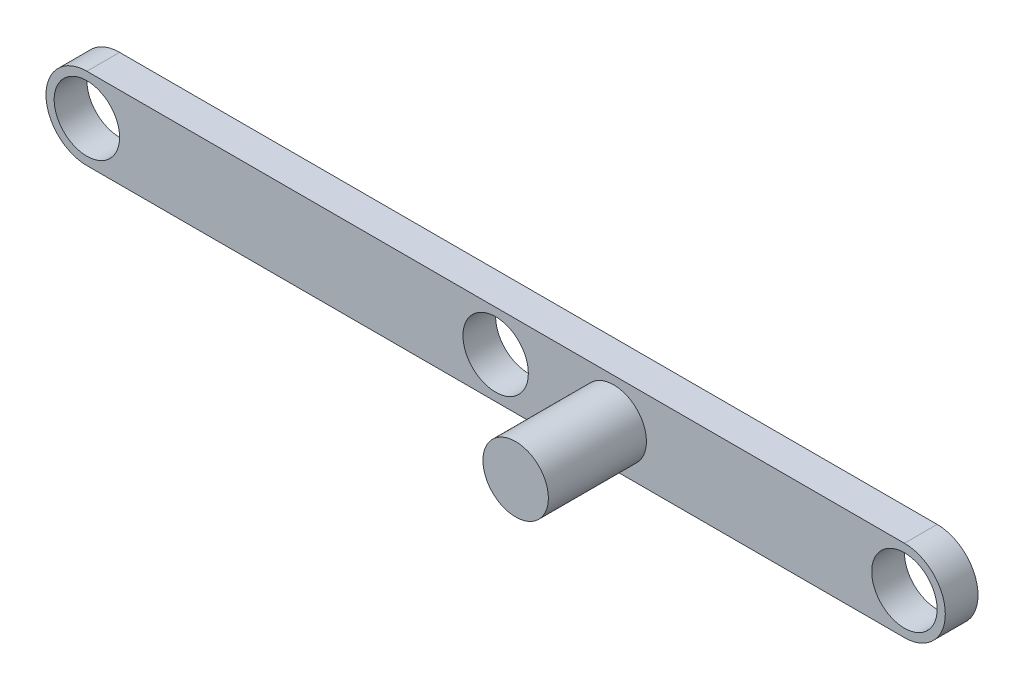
ISO-10303-21;
HEADER;
FILE_DESCRIPTION(('STEP AP214'),'2;1');
FILE_NAME('part.step','',(''),(''),'','','');
FILE_SCHEMA(('AUTOMOTIVE_DESIGN { 1 0 10303 214 1 1 1 1 }'));
ENDSEC;
DATA;
#1=APPLICATION_CONTEXT('core data for automotive mechanical design processes');
#2=APPLICATION_PROTOCOL_DEFINITION('international standard','automotive_design',2000,#1);
#3=PRODUCT_CONTEXT('',#1,'mechanical');
#4=PRODUCT('Part','Part','',(#3));
#5=PRODUCT_RELATED_PRODUCT_CATEGORY('part','',(#4));
#6=PRODUCT_DEFINITION_FORMATION('','',#4);
#7=PRODUCT_DEFINITION_CONTEXT('part definition',#1,'design');
#8=PRODUCT_DEFINITION('design','',#6,#7);
#9=PRODUCT_DEFINITION_SHAPE('','',#8);
#10=(LENGTH_UNIT() NAMED_UNIT(*) SI_UNIT(.MILLI.,.METRE.));
#11=(NAMED_UNIT(*) PLANE_ANGLE_UNIT() SI_UNIT($,.RADIAN.));
#12=(NAMED_UNIT(*) SI_UNIT($,.STERADIAN.) SOLID_ANGLE_UNIT());
#13=UNCERTAINTY_MEASURE_WITH_UNIT(LENGTH_MEASURE(1.E-05),#10,'distance_accuracy_value','');
#14=(GEOMETRIC_REPRESENTATION_CONTEXT(3) GLOBAL_UNCERTAINTY_ASSIGNED_CONTEXT((#13)) GLOBAL_UNIT_ASSIGNED_CONTEXT((#10,
#11,#12)) REPRESENTATION_CONTEXT('',''));
#15=CARTESIAN_POINT('',(0.,0.,0.));
#16=DIRECTION('',(0.,0.,1.));
#17=DIRECTION('',(1.,0.,0.));
#18=AXIS2_PLACEMENT_3D('',#15,#16,#17);
#19=CARTESIAN_POINT('',(1275.04046692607,63.4999999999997,0.));
#20=DIRECTION('',(0.,0.,-0.999999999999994));
#21=DIRECTION('',(-0.999999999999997,0.,0.));
#22=AXIS2_PLACEMENT_3D('',#19,#20,#21);
#23=PLANE('',#22);
#24=CARTESIAN_POINT('',(1275.04046692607,63.4999999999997,0.));
#25=DIRECTION('',(0.,0.,0.999999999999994));
#26=DIRECTION('',(-0.999999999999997,0.,0.));
#27=AXIS2_PLACEMENT_3D('',#24,#25,#26);
#28=CIRCLE('',#27,63.5);
#29=CARTESIAN_POINT('',(1275.04046692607,0.,0.));
#30=VERTEX_POINT('',#29);
#31=CARTESIAN_POINT('',(1275.04046692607,127.,0.));
#32=VERTEX_POINT('',#31);
#33=EDGE_CURVE('E391',#30,#32,#28,.T.);
#34=ORIENTED_EDGE('',*,*,#33,.T.);
#35=DIRECTION('',(-0.999999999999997,0.,0.));
#36=VECTOR('',#35,1.);
#37=CARTESIAN_POINT('',(1275.04046692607,127.,0.));
#38=LINE('',#37,#36);
#39=CARTESIAN_POINT('',(5.04046692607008,127.,0.));
#40=VERTEX_POINT('',#39);
#41=EDGE_CURVE('E400',#32,#40,#38,.T.);
#42=ORIENTED_EDGE('',*,*,#41,.T.);
#43=CARTESIAN_POINT('',(5.04046692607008,63.5000000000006,0.));
#44=DIRECTION('',(0.,0.,0.999999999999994));
#45=DIRECTION('',(0.999999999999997,0.,0.));
#46=AXIS2_PLACEMENT_3D('',#43,#44,#45);
#47=CIRCLE('',#46,63.5);
#48=CARTESIAN_POINT('',(5.04046692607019,-2.22044604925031E-13,0.));
#49=VERTEX_POINT('',#48);
#50=EDGE_CURVE('E405',#40,#49,#47,.T.);
#51=ORIENTED_EDGE('',*,*,#50,.T.);
#52=DIRECTION('',(1.,0.,0.));
#53=VECTOR('',#52,1.);
#54=CARTESIAN_POINT('',(1275.04046692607,0.,0.));
#55=LINE('',#54,#53);
#56=EDGE_CURVE('E408',#49,#30,#55,.T.);
#57=ORIENTED_EDGE('',*,*,#56,.T.);
#58=EDGE_LOOP('',(#34,#42,#51,#57));
#59=FACE_BOUND('',#58,.T.);
#60=CARTESIAN_POINT('',(640.04046692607,63.5000000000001,0.));
#61=DIRECTION('',(0.,0.,0.999999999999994));
#62=DIRECTION('',(0.999999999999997,0.,0.));
#63=AXIS2_PLACEMENT_3D('',#60,#61,#62);
#64=CIRCLE('',#63,50.8);
#65=CARTESIAN_POINT('',(690.84046692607,63.5,0.));
#66=VERTEX_POINT('',#65);
#67=EDGE_CURVE('E412',#66,#66,#64,.T.);
#68=ORIENTED_EDGE('',*,*,#67,.F.);
#69=EDGE_LOOP('',(#68));
#70=FACE_BOUND('',#69,.T.);
#71=CARTESIAN_POINT('',(1275.04046692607,63.4999999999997,0.));
#72=DIRECTION('',(0.,0.,0.999999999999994));
#73=DIRECTION('',(0.999999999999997,0.,0.));
#74=AXIS2_PLACEMENT_3D('',#71,#72,#73);
#75=CIRCLE('',#74,50.8);
#76=CARTESIAN_POINT('',(1325.84046692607,63.4999999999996,0.));
#77=VERTEX_POINT('',#76);
#78=EDGE_CURVE('E480',#77,#77,#75,.T.);
#79=ORIENTED_EDGE('',*,*,#78,.F.);
#80=EDGE_LOOP('',(#79));
#81=FACE_BOUND('',#80,.T.);
#82=CARTESIAN_POINT('',(5.04046692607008,63.5000000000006,0.));
#83=DIRECTION('',(0.,0.,0.999999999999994));
#84=DIRECTION('',(0.999999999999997,0.,0.));
#85=AXIS2_PLACEMENT_3D('',#82,#83,#84);
#86=CIRCLE('',#85,50.8);
#87=CARTESIAN_POINT('',(55.84046692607,63.4999999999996,0.));
#88=VERTEX_POINT('',#87);
#89=EDGE_CURVE('E470',#88,#88,#86,.T.);
#90=ORIENTED_EDGE('',*,*,#89,.F.);
#91=EDGE_LOOP('',(#90));
#92=FACE_BOUND('',#91,.T.);
#93=CARTESIAN_POINT('',(823.47438328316,63.5000000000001,0.));
#94=DIRECTION('',(0.,0.,0.999999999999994));
#95=DIRECTION('',(0.999999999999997,0.,0.));
#96=AXIS2_PLACEMENT_3D('',#93,#94,#95);
#97=CIRCLE('',#96,50.8);
#98=CARTESIAN_POINT('',(772.67438328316,63.5000000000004,0.));
#99=VERTEX_POINT('',#98);
#100=EDGE_CURVE('E471',#99,#99,#97,.T.);
#101=ORIENTED_EDGE('',*,*,#100,.F.);
#102=EDGE_LOOP('',(#101));
#103=FACE_BOUND('',#102,.T.);
#104=ADVANCED_FACE('F350',(#59,#70,#81,#92,#103),#23,.F.);
#105=CARTESIAN_POINT('',(1275.04046692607,63.4999999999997,-50.7999999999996));
#106=DIRECTION('',(0.,0.,0.999999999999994));
#107=DIRECTION('',(0.999999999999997,0.,0.));
#108=AXIS2_PLACEMENT_3D('',#105,#106,#107);
#109=CYLINDRICAL_SURFACE('',#108,63.5);
#110=ORIENTED_EDGE('',*,*,#33,.F.);
#111=DIRECTION('',(0.,0.,0.999999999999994));
#112=VECTOR('',#111,1.);
#113=CARTESIAN_POINT('',(1275.04046692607,0.,-50.7999999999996));
#114=LINE('',#113,#112);
#115=CARTESIAN_POINT('',(1275.04046692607,0.,-50.7999999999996));
#116=VERTEX_POINT('',#115);
#117=EDGE_CURVE('E11',#116,#30,#114,.T.);
#118=ORIENTED_EDGE('',*,*,#117,.F.);
#119=CARTESIAN_POINT('',(1275.04046692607,63.4999999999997,-50.7999999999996));
#120=DIRECTION('',(0.,0.,0.999999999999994));
#121=DIRECTION('',(-0.999999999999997,0.,0.));
#122=AXIS2_PLACEMENT_3D('',#119,#120,#121);
#123=CIRCLE('',#122,63.5);
#124=CARTESIAN_POINT('',(1275.04046692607,127.,-50.7999999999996));
#125=VERTEX_POINT('',#124);
#126=EDGE_CURVE('E393',#116,#125,#123,.T.);
#127=ORIENTED_EDGE('',*,*,#126,.T.);
#128=DIRECTION('',(0.,0.,0.999999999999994));
#129=VECTOR('',#128,1.);
#130=CARTESIAN_POINT('',(1275.04046692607,127.,-50.7999999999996));
#131=LINE('',#130,#129);
#132=EDGE_CURVE('E354',#125,#32,#131,.T.);
#133=ORIENTED_EDGE('',*,*,#132,.T.);
#134=EDGE_LOOP('',(#110,#118,#127,#133));
#135=FACE_BOUND('',#134,.T.);
#136=ADVANCED_FACE('F352',(#135),#109,.T.);
#137=CARTESIAN_POINT('',(1275.04046692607,0.,-50.7999999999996));
#138=DIRECTION('',(0.,-0.999999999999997,0.));
#139=DIRECTION('',(0.999999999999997,0.,0.));
#140=AXIS2_PLACEMENT_3D('',#137,#138,#139);
#141=PLANE('',#140);
#142=ORIENTED_EDGE('',*,*,#56,.F.);
#143=DIRECTION('',(0.,0.,0.999999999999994));
#144=VECTOR('',#143,1.);
#145=CARTESIAN_POINT('',(5.04046692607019,-2.22044604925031E-13,-50.7999999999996));
#146=LINE('',#145,#144);
#147=CARTESIAN_POINT('',(5.04046692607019,-2.22044604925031E-13,-50.7999999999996));
#148=VERTEX_POINT('',#147);
#149=EDGE_CURVE('E359',#148,#49,#146,.T.);
#150=ORIENTED_EDGE('',*,*,#149,.F.);
#151=DIRECTION('',(1.,0.,0.));
#152=VECTOR('',#151,1.);
#153=CARTESIAN_POINT('',(1275.04046692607,0.,-50.7999999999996));
#154=LINE('',#153,#152);
#155=EDGE_CURVE('E398',#148,#116,#154,.T.);
#156=ORIENTED_EDGE('',*,*,#155,.T.);
#157=ORIENTED_EDGE('',*,*,#117,.T.);
#158=EDGE_LOOP('',(#142,#150,#156,#157));
#159=FACE_BOUND('',#158,.T.);
#160=ADVANCED_FACE('F428',(#159),#141,.T.);
#161=CARTESIAN_POINT('',(5.04046692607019,63.4999999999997,-50.7999999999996));
#162=DIRECTION('',(0.,0.,0.999999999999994));
#163=DIRECTION('',(0.999999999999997,0.,0.));
#164=AXIS2_PLACEMENT_3D('',#161,#162,#163);
#165=CYLINDRICAL_SURFACE('',#164,63.5);
#166=ORIENTED_EDGE('',*,*,#50,.F.);
#167=DIRECTION('',(0.,0.,0.999999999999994));
#168=VECTOR('',#167,1.);
#169=CARTESIAN_POINT('',(5.04046692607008,127.,-50.7999999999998));
#170=LINE('',#169,#168);
#171=CARTESIAN_POINT('',(5.04046692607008,127.,-50.7999999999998));
#172=VERTEX_POINT('',#171);
#173=EDGE_CURVE('E397',#172,#40,#170,.T.);
#174=ORIENTED_EDGE('',*,*,#173,.F.);
#175=CARTESIAN_POINT('',(5.04046692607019,63.4999999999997,-50.7999999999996));
#176=DIRECTION('',(0.,0.,0.999999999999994));
#177=DIRECTION('',(0.999999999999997,0.,0.));
#178=AXIS2_PLACEMENT_3D('',#175,#176,#177);
#179=CIRCLE('',#178,63.5);
#180=EDGE_CURVE('E421',#172,#148,#179,.T.);
#181=ORIENTED_EDGE('',*,*,#180,.T.);
#182=ORIENTED_EDGE('',*,*,#149,.T.);
#183=EDGE_LOOP('',(#166,#174,#181,#182));
#184=FACE_BOUND('',#183,.T.);
#185=ADVANCED_FACE('F425',(#184),#165,.T.);
#186=CARTESIAN_POINT('',(1275.04046692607,127.,-50.7999999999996));
#187=DIRECTION('',(0.,1.,0.));
#188=DIRECTION('',(-1.,0.,0.));
#189=AXIS2_PLACEMENT_3D('',#186,#187,#188);
#190=PLANE('',#189);
#191=ORIENTED_EDGE('',*,*,#41,.F.);
#192=ORIENTED_EDGE('',*,*,#132,.F.);
#193=DIRECTION('',(-0.999999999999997,0.,0.));
#194=VECTOR('',#193,1.);
#195=CARTESIAN_POINT('',(1275.04046692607,127.,-50.7999999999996));
#196=LINE('',#195,#194);
#197=EDGE_CURVE('E419',#125,#172,#196,.T.);
#198=ORIENTED_EDGE('',*,*,#197,.T.);
#199=ORIENTED_EDGE('',*,*,#173,.T.);
#200=EDGE_LOOP('',(#191,#192,#198,#199));
#201=FACE_BOUND('',#200,.T.);
#202=ADVANCED_FACE('F401',(#201),#190,.T.);
#203=CARTESIAN_POINT('',(1275.04046692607,63.4999999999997,-50.7999999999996));
#204=DIRECTION('',(0.,0.,-0.999999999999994));
#205=DIRECTION('',(-0.999999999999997,0.,0.));
#206=AXIS2_PLACEMENT_3D('',#203,#204,#205);
#207=PLANE('',#206);
#208=CARTESIAN_POINT('',(5.04046692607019,63.4999999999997,-50.7999999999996));
#209=DIRECTION('',(0.,0.,0.999999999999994));
#210=DIRECTION('',(0.999999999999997,0.,0.));
#211=AXIS2_PLACEMENT_3D('',#208,#209,#210);
#212=CIRCLE('',#211,50.8);
#213=CARTESIAN_POINT('',(55.84046692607,63.4999999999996,-50.7999999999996));
#214=VERTEX_POINT('',#213);
#215=EDGE_CURVE('E474',#214,#214,#212,.T.);
#216=ORIENTED_EDGE('',*,*,#215,.T.);
#217=EDGE_LOOP('',(#216));
#218=FACE_BOUND('',#217,.T.);
#219=CARTESIAN_POINT('',(1275.04046692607,63.4999999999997,-50.7999999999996));
#220=DIRECTION('',(0.,0.,0.999999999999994));
#221=DIRECTION('',(0.999999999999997,0.,0.));
#222=AXIS2_PLACEMENT_3D('',#219,#220,#221);
#223=CIRCLE('',#222,50.8);
#224=CARTESIAN_POINT('',(1325.84046692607,63.4999999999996,-50.7999999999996));
#225=VERTEX_POINT('',#224);
#226=EDGE_CURVE('E483',#225,#225,#223,.T.);
#227=ORIENTED_EDGE('',*,*,#226,.T.);
#228=EDGE_LOOP('',(#227));
#229=FACE_BOUND('',#228,.T.);
#230=CARTESIAN_POINT('',(640.04046692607,63.5000000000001,-50.7999999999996));
#231=DIRECTION('',(0.,0.,0.999999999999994));
#232=DIRECTION('',(0.999999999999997,0.,0.));
#233=AXIS2_PLACEMENT_3D('',#230,#231,#232);
#234=CIRCLE('',#233,50.8);
#235=CARTESIAN_POINT('',(690.84046692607,63.5,-50.7999999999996));
#236=VERTEX_POINT('',#235);
#237=EDGE_CURVE('E409',#236,#236,#234,.T.);
#238=ORIENTED_EDGE('',*,*,#237,.T.);
#239=EDGE_LOOP('',(#238));
#240=FACE_BOUND('',#239,.T.);
#241=ORIENTED_EDGE('',*,*,#126,.F.);
#242=ORIENTED_EDGE('',*,*,#155,.F.);
#243=ORIENTED_EDGE('',*,*,#180,.F.);
#244=ORIENTED_EDGE('',*,*,#197,.F.);
#245=EDGE_LOOP('',(#241,#242,#243,#244));
#246=FACE_BOUND('',#245,.T.);
#247=ADVANCED_FACE('F430',(#218,#229,#240,#246),#207,.T.);
#248=CARTESIAN_POINT('',(640.04046692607,63.5000000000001,-50.7999999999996));
#249=DIRECTION('',(0.,0.,0.999999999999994));
#250=DIRECTION('',(0.999999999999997,0.,0.));
#251=AXIS2_PLACEMENT_3D('',#248,#249,#250);
#252=CYLINDRICAL_SURFACE('',#251,50.8);
#253=CARTESIAN_POINT('',(690.84046692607,63.5,-50.7999999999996));
#254=CARTESIAN_POINT('',(690.84046692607,63.5,-50.2708333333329));
#255=CARTESIAN_POINT('',(690.84046692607,63.5,-49.7416666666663));
#256=CARTESIAN_POINT('',(690.84046692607,63.5,-48.6833333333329));
#257=CARTESIAN_POINT('',(690.84046692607,63.5,-48.1541666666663));
#258=CARTESIAN_POINT('',(690.84046692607,63.5,-47.095833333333));
#259=CARTESIAN_POINT('',(690.84046692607,63.5,-46.5666666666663));
#260=CARTESIAN_POINT('',(690.84046692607,63.5,-45.508333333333));
#261=CARTESIAN_POINT('',(690.84046692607,63.5,-44.9791666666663));
#262=CARTESIAN_POINT('',(690.84046692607,63.5,-43.920833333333));
#263=CARTESIAN_POINT('',(690.84046692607,63.5,-43.3916666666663));
#264=CARTESIAN_POINT('',(690.84046692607,63.5,-42.333333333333));
#265=CARTESIAN_POINT('',(690.84046692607,63.5,-41.8041666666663));
#266=CARTESIAN_POINT('',(690.84046692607,63.5,-40.745833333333));
#267=CARTESIAN_POINT('',(690.84046692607,63.5,-40.2166666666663));
#268=CARTESIAN_POINT('',(690.84046692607,63.5,-39.158333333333));
#269=CARTESIAN_POINT('',(690.84046692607,63.5,-38.6291666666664));
#270=CARTESIAN_POINT('',(690.84046692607,63.5,-37.570833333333));
#271=CARTESIAN_POINT('',(690.84046692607,63.5,-37.0416666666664));
#272=CARTESIAN_POINT('',(690.84046692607,63.5,-35.983333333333));
#273=CARTESIAN_POINT('',(690.84046692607,63.5,-35.4541666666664));
#274=CARTESIAN_POINT('',(690.84046692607,63.5,-34.3958333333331));
#275=CARTESIAN_POINT('',(690.84046692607,63.5,-33.8666666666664));
#276=CARTESIAN_POINT('',(690.84046692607,63.5,-32.8083333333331));
#277=CARTESIAN_POINT('',(690.84046692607,63.5,-32.2791666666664));
#278=CARTESIAN_POINT('',(690.84046692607,63.5,-31.2208333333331));
#279=CARTESIAN_POINT('',(690.84046692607,63.5,-30.6916666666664));
#280=CARTESIAN_POINT('',(690.84046692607,63.5,-29.6333333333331));
#281=CARTESIAN_POINT('',(690.84046692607,63.5,-29.1041666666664));
#282=CARTESIAN_POINT('',(690.84046692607,63.5,-28.0458333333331));
#283=CARTESIAN_POINT('',(690.84046692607,63.5,-27.5166666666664));
#284=CARTESIAN_POINT('',(690.84046692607,63.5,-26.4583333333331));
#285=CARTESIAN_POINT('',(690.84046692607,63.5,-25.9291666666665));
#286=CARTESIAN_POINT('',(690.84046692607,63.5,-24.8708333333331));
#287=CARTESIAN_POINT('',(690.84046692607,63.5,-24.3416666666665));
#288=CARTESIAN_POINT('',(690.84046692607,63.5,-23.2833333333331));
#289=CARTESIAN_POINT('',(690.84046692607,63.5,-22.7541666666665));
#290=CARTESIAN_POINT('',(690.84046692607,63.5,-21.6958333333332));
#291=CARTESIAN_POINT('',(690.84046692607,63.5,-21.1666666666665));
#292=CARTESIAN_POINT('',(690.84046692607,63.5,-20.1083333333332));
#293=CARTESIAN_POINT('',(690.84046692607,63.5,-19.5791666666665));
#294=CARTESIAN_POINT('',(690.84046692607,63.5,-18.5208333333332));
#295=CARTESIAN_POINT('',(690.84046692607,63.5,-17.9916666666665));
#296=CARTESIAN_POINT('',(690.84046692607,63.5,-16.9333333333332));
#297=CARTESIAN_POINT('',(690.84046692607,63.5,-16.4041666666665));
#298=CARTESIAN_POINT('',(690.84046692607,63.5,-15.3458333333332));
#299=CARTESIAN_POINT('',(690.84046692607,63.5,-14.8166666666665));
#300=CARTESIAN_POINT('',(690.84046692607,63.5,-13.7583333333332));
#301=CARTESIAN_POINT('',(690.84046692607,63.5,-13.2291666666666));
#302=CARTESIAN_POINT('',(690.84046692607,63.5,-12.1708333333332));
#303=CARTESIAN_POINT('',(690.84046692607,63.5,-11.6416666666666));
#304=CARTESIAN_POINT('',(690.84046692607,63.5,-10.5833333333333));
#305=CARTESIAN_POINT('',(690.84046692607,63.5,-10.0541666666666));
#306=CARTESIAN_POINT('',(690.84046692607,63.5,-8.99583333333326));
#307=CARTESIAN_POINT('',(690.84046692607,63.5,-8.4666666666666));
#308=CARTESIAN_POINT('',(690.84046692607,63.5,-7.40833333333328));
#309=CARTESIAN_POINT('',(690.84046692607,63.5,-6.87916666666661));
#310=CARTESIAN_POINT('',(690.84046692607,63.5,-5.82083333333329));
#311=CARTESIAN_POINT('',(690.84046692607,63.5,-5.29166666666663));
#312=CARTESIAN_POINT('',(690.84046692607,63.5,-4.2333333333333));
#313=CARTESIAN_POINT('',(690.84046692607,63.5,-3.70416666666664));
#314=CARTESIAN_POINT('',(690.84046692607,63.5,-2.64583333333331));
#315=CARTESIAN_POINT('',(690.84046692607,63.5,-2.11666666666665));
#316=CARTESIAN_POINT('',(690.84046692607,63.5,-1.05833333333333));
#317=CARTESIAN_POINT('',(690.84046692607,63.5,-0.529166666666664));
#318=CARTESIAN_POINT('',(690.84046692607,63.5,0.));
#319=B_SPLINE_CURVE_WITH_KNOTS('',3,(#253,#254,#255,#256,#257,#258,#259,#260,#261,#262,#263,
#264,#265,#266,#267,#268,#269,#270,#271,#272,#273,#274,#275,#276,#277,#278,#279,#280,#281,#282,
#283,#284,#285,#286,#287,#288,#289,#290,#291,#292,#293,#294,#295,#296,#297,#298,#299,#300,#301,
#302,#303,#304,#305,#306,#307,#308,#309,#310,#311,#312,#313,#314,#315,#316,#317,#318),
.UNSPECIFIED.,.F.,.F.,(4,2,2,2,2,2,2,2,2,2,2,2,2,2,2,2,2,2,2,2,2,2,2,2,2,2,2,2,2,2,2,2,4),(0.,
1.58749999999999,3.17499999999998,4.76249999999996,6.34999999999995,7.93749999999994,
9.52499999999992,11.1124999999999,12.6999999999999,14.2874999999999,15.8749999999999,
17.4624999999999,19.0499999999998,20.6374999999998,22.2249999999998,23.8124999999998,
25.3999999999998,26.9874999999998,28.5749999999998,30.1624999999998,31.7499999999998,
33.3374999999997,34.9249999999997,36.5124999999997,38.0999999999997,39.6874999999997,
41.2749999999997,42.8624999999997,44.4499999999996,46.0374999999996,47.6249999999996,
49.2124999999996,50.7999999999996),.UNSPECIFIED.);
#320=EDGE_CURVE('BSEAM432',#236,#66,#319,.T.);
#321=ORIENTED_EDGE('',*,*,#237,.F.);
#322=ORIENTED_EDGE('',*,*,#67,.T.);
#323=ORIENTED_EDGE('',*,*,#320,.T.);
#324=ORIENTED_EDGE('',*,*,#320,.F.);
#325=EDGE_LOOP('',(#321,#323,#322,#324));
#326=FACE_BOUND('',#325,.T.);
#327=ADVANCED_FACE('F432',(#326),#252,.F.);
#328=CARTESIAN_POINT('',(1275.04046692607,63.4999999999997,-50.7999999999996));
#329=DIRECTION('',(0.,0.,0.999999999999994));
#330=DIRECTION('',(0.999999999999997,0.,0.));
#331=AXIS2_PLACEMENT_3D('',#328,#329,#330);
#332=CYLINDRICAL_SURFACE('',#331,50.8);
#333=CARTESIAN_POINT('',(1325.84046692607,63.4999999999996,-50.7999999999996));
#334=CARTESIAN_POINT('',(1325.84046692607,63.4999999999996,-50.2708333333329));
#335=CARTESIAN_POINT('',(1325.84046692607,63.4999999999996,-49.7416666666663));
#336=CARTESIAN_POINT('',(1325.84046692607,63.4999999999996,-48.6833333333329));
#337=CARTESIAN_POINT('',(1325.84046692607,63.4999999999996,-48.1541666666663));
#338=CARTESIAN_POINT('',(1325.84046692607,63.4999999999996,-47.095833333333));
#339=CARTESIAN_POINT('',(1325.84046692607,63.4999999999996,-46.5666666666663));
#340=CARTESIAN_POINT('',(1325.84046692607,63.4999999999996,-45.508333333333));
#341=CARTESIAN_POINT('',(1325.84046692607,63.4999999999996,-44.9791666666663));
#342=CARTESIAN_POINT('',(1325.84046692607,63.4999999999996,-43.920833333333));
#343=CARTESIAN_POINT('',(1325.84046692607,63.4999999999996,-43.3916666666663));
#344=CARTESIAN_POINT('',(1325.84046692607,63.4999999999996,-42.333333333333));
#345=CARTESIAN_POINT('',(1325.84046692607,63.4999999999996,-41.8041666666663));
#346=CARTESIAN_POINT('',(1325.84046692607,63.4999999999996,-40.745833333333));
#347=CARTESIAN_POINT('',(1325.84046692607,63.4999999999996,-40.2166666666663));
#348=CARTESIAN_POINT('',(1325.84046692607,63.4999999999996,-39.158333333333));
#349=CARTESIAN_POINT('',(1325.84046692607,63.4999999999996,-38.6291666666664));
#350=CARTESIAN_POINT('',(1325.84046692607,63.4999999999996,-37.570833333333));
#351=CARTESIAN_POINT('',(1325.84046692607,63.4999999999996,-37.0416666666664));
#352=CARTESIAN_POINT('',(1325.84046692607,63.4999999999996,-35.983333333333));
#353=CARTESIAN_POINT('',(1325.84046692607,63.4999999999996,-35.4541666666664));
#354=CARTESIAN_POINT('',(1325.84046692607,63.4999999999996,-34.3958333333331));
#355=CARTESIAN_POINT('',(1325.84046692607,63.4999999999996,-33.8666666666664));
#356=CARTESIAN_POINT('',(1325.84046692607,63.4999999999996,-32.8083333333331));
#357=CARTESIAN_POINT('',(1325.84046692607,63.4999999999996,-32.2791666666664));
#358=CARTESIAN_POINT('',(1325.84046692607,63.4999999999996,-31.2208333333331));
#359=CARTESIAN_POINT('',(1325.84046692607,63.4999999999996,-30.6916666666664));
#360=CARTESIAN_POINT('',(1325.84046692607,63.4999999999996,-29.6333333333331));
#361=CARTESIAN_POINT('',(1325.84046692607,63.4999999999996,-29.1041666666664));
#362=CARTESIAN_POINT('',(1325.84046692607,63.4999999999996,-28.0458333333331));
#363=CARTESIAN_POINT('',(1325.84046692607,63.4999999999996,-27.5166666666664));
#364=CARTESIAN_POINT('',(1325.84046692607,63.4999999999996,-26.4583333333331));
#365=CARTESIAN_POINT('',(1325.84046692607,63.4999999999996,-25.9291666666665));
#366=CARTESIAN_POINT('',(1325.84046692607,63.4999999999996,-24.8708333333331));
#367=CARTESIAN_POINT('',(1325.84046692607,63.4999999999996,-24.3416666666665));
#368=CARTESIAN_POINT('',(1325.84046692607,63.4999999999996,-23.2833333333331));
#369=CARTESIAN_POINT('',(1325.84046692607,63.4999999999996,-22.7541666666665));
#370=CARTESIAN_POINT('',(1325.84046692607,63.4999999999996,-21.6958333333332));
#371=CARTESIAN_POINT('',(1325.84046692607,63.4999999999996,-21.1666666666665));
#372=CARTESIAN_POINT('',(1325.84046692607,63.4999999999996,-20.1083333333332));
#373=CARTESIAN_POINT('',(1325.84046692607,63.4999999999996,-19.5791666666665));
#374=CARTESIAN_POINT('',(1325.84046692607,63.4999999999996,-18.5208333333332));
#375=CARTESIAN_POINT('',(1325.84046692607,63.4999999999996,-17.9916666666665));
#376=CARTESIAN_POINT('',(1325.84046692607,63.4999999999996,-16.9333333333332));
#377=CARTESIAN_POINT('',(1325.84046692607,63.4999999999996,-16.4041666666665));
#378=CARTESIAN_POINT('',(1325.84046692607,63.4999999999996,-15.3458333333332));
#379=CARTESIAN_POINT('',(1325.84046692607,63.4999999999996,-14.8166666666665));
#380=CARTESIAN_POINT('',(1325.84046692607,63.4999999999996,-13.7583333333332));
#381=CARTESIAN_POINT('',(1325.84046692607,63.4999999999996,-13.2291666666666));
#382=CARTESIAN_POINT('',(1325.84046692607,63.4999999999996,-12.1708333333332));
#383=CARTESIAN_POINT('',(1325.84046692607,63.4999999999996,-11.6416666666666));
#384=CARTESIAN_POINT('',(1325.84046692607,63.4999999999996,-10.5833333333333));
#385=CARTESIAN_POINT('',(1325.84046692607,63.4999999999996,-10.0541666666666));
#386=CARTESIAN_POINT('',(1325.84046692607,63.4999999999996,-8.99583333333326));
#387=CARTESIAN_POINT('',(1325.84046692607,63.4999999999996,-8.4666666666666));
#388=CARTESIAN_POINT('',(1325.84046692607,63.4999999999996,-7.40833333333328));
#389=CARTESIAN_POINT('',(1325.84046692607,63.4999999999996,-6.87916666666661));
#390=CARTESIAN_POINT('',(1325.84046692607,63.4999999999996,-5.82083333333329));
#391=CARTESIAN_POINT('',(1325.84046692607,63.4999999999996,-5.29166666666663));
#392=CARTESIAN_POINT('',(1325.84046692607,63.4999999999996,-4.2333333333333));
#393=CARTESIAN_POINT('',(1325.84046692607,63.4999999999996,-3.70416666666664));
#394=CARTESIAN_POINT('',(1325.84046692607,63.4999999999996,-2.64583333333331));
#395=CARTESIAN_POINT('',(1325.84046692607,63.4999999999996,-2.11666666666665));
#396=CARTESIAN_POINT('',(1325.84046692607,63.4999999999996,-1.05833333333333));
#397=CARTESIAN_POINT('',(1325.84046692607,63.4999999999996,-0.529166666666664));
#398=CARTESIAN_POINT('',(1325.84046692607,63.4999999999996,0.));
#399=B_SPLINE_CURVE_WITH_KNOTS('',3,(#333,#334,#335,#336,#337,#338,#339,#340,#341,#342,#343,
#344,#345,#346,#347,#348,#349,#350,#351,#352,#353,#354,#355,#356,#357,#358,#359,#360,#361,#362,
#363,#364,#365,#366,#367,#368,#369,#370,#371,#372,#373,#374,#375,#376,#377,#378,#379,#380,#381,
#382,#383,#384,#385,#386,#387,#388,#389,#390,#391,#392,#393,#394,#395,#396,#397,#398),
.UNSPECIFIED.,.F.,.F.,(4,2,2,2,2,2,2,2,2,2,2,2,2,2,2,2,2,2,2,2,2,2,2,2,2,2,2,2,2,2,2,2,4),(0.,
1.58749999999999,3.17499999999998,4.76249999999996,6.34999999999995,7.93749999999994,
9.52499999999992,11.1124999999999,12.6999999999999,14.2874999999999,15.8749999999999,
17.4624999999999,19.0499999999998,20.6374999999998,22.2249999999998,23.8124999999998,
25.3999999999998,26.9874999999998,28.5749999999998,30.1624999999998,31.7499999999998,
33.3374999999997,34.9249999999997,36.5124999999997,38.0999999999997,39.6874999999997,
41.2749999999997,42.8624999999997,44.4499999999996,46.0374999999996,47.6249999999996,
49.2124999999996,50.7999999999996),.UNSPECIFIED.);
#400=EDGE_CURVE('BSEAM439',#225,#77,#399,.T.);
#401=ORIENTED_EDGE('',*,*,#226,.F.);
#402=ORIENTED_EDGE('',*,*,#78,.T.);
#403=ORIENTED_EDGE('',*,*,#400,.T.);
#404=ORIENTED_EDGE('',*,*,#400,.F.);
#405=EDGE_LOOP('',(#401,#403,#402,#404));
#406=FACE_BOUND('',#405,.T.);
#407=ADVANCED_FACE('F439',(#406),#332,.F.);
#408=CARTESIAN_POINT('',(5.04046692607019,63.4999999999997,-50.7999999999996));
#409=DIRECTION('',(0.,0.,0.999999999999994));
#410=DIRECTION('',(0.999999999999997,0.,0.));
#411=AXIS2_PLACEMENT_3D('',#408,#409,#410);
#412=CYLINDRICAL_SURFACE('',#411,50.8);
#413=CARTESIAN_POINT('',(55.84046692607,63.4999999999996,-50.7999999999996));
#414=CARTESIAN_POINT('',(55.84046692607,63.4999999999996,-50.2708333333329));
#415=CARTESIAN_POINT('',(55.84046692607,63.4999999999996,-49.7416666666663));
#416=CARTESIAN_POINT('',(55.84046692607,63.4999999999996,-48.6833333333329));
#417=CARTESIAN_POINT('',(55.84046692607,63.4999999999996,-48.1541666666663));
#418=CARTESIAN_POINT('',(55.84046692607,63.4999999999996,-47.095833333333));
#419=CARTESIAN_POINT('',(55.84046692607,63.4999999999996,-46.5666666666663));
#420=CARTESIAN_POINT('',(55.84046692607,63.4999999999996,-45.508333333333));
#421=CARTESIAN_POINT('',(55.84046692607,63.4999999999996,-44.9791666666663));
#422=CARTESIAN_POINT('',(55.84046692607,63.4999999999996,-43.920833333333));
#423=CARTESIAN_POINT('',(55.84046692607,63.4999999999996,-43.3916666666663));
#424=CARTESIAN_POINT('',(55.84046692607,63.4999999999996,-42.333333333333));
#425=CARTESIAN_POINT('',(55.84046692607,63.4999999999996,-41.8041666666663));
#426=CARTESIAN_POINT('',(55.84046692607,63.4999999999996,-40.745833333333));
#427=CARTESIAN_POINT('',(55.84046692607,63.4999999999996,-40.2166666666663));
#428=CARTESIAN_POINT('',(55.84046692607,63.4999999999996,-39.158333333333));
#429=CARTESIAN_POINT('',(55.84046692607,63.4999999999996,-38.6291666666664));
#430=CARTESIAN_POINT('',(55.84046692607,63.4999999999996,-37.570833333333));
#431=CARTESIAN_POINT('',(55.84046692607,63.4999999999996,-37.0416666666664));
#432=CARTESIAN_POINT('',(55.84046692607,63.4999999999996,-35.983333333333));
#433=CARTESIAN_POINT('',(55.84046692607,63.4999999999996,-35.4541666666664));
#434=CARTESIAN_POINT('',(55.84046692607,63.4999999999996,-34.3958333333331));
#435=CARTESIAN_POINT('',(55.84046692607,63.4999999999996,-33.8666666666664));
#436=CARTESIAN_POINT('',(55.84046692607,63.4999999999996,-32.8083333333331));
#437=CARTESIAN_POINT('',(55.84046692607,63.4999999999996,-32.2791666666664));
#438=CARTESIAN_POINT('',(55.84046692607,63.4999999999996,-31.2208333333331));
#439=CARTESIAN_POINT('',(55.84046692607,63.4999999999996,-30.6916666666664));
#440=CARTESIAN_POINT('',(55.84046692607,63.4999999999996,-29.6333333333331));
#441=CARTESIAN_POINT('',(55.84046692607,63.4999999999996,-29.1041666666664));
#442=CARTESIAN_POINT('',(55.84046692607,63.4999999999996,-28.0458333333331));
#443=CARTESIAN_POINT('',(55.84046692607,63.4999999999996,-27.5166666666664));
#444=CARTESIAN_POINT('',(55.84046692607,63.4999999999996,-26.4583333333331));
#445=CARTESIAN_POINT('',(55.84046692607,63.4999999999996,-25.9291666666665));
#446=CARTESIAN_POINT('',(55.84046692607,63.4999999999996,-24.8708333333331));
#447=CARTESIAN_POINT('',(55.84046692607,63.4999999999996,-24.3416666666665));
#448=CARTESIAN_POINT('',(55.84046692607,63.4999999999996,-23.2833333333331));
#449=CARTESIAN_POINT('',(55.84046692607,63.4999999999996,-22.7541666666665));
#450=CARTESIAN_POINT('',(55.84046692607,63.4999999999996,-21.6958333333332));
#451=CARTESIAN_POINT('',(55.84046692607,63.4999999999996,-21.1666666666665));
#452=CARTESIAN_POINT('',(55.84046692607,63.4999999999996,-20.1083333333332));
#453=CARTESIAN_POINT('',(55.84046692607,63.4999999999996,-19.5791666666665));
#454=CARTESIAN_POINT('',(55.84046692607,63.4999999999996,-18.5208333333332));
#455=CARTESIAN_POINT('',(55.84046692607,63.4999999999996,-17.9916666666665));
#456=CARTESIAN_POINT('',(55.84046692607,63.4999999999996,-16.9333333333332));
#457=CARTESIAN_POINT('',(55.84046692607,63.4999999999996,-16.4041666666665));
#458=CARTESIAN_POINT('',(55.84046692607,63.4999999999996,-15.3458333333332));
#459=CARTESIAN_POINT('',(55.84046692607,63.4999999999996,-14.8166666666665));
#460=CARTESIAN_POINT('',(55.84046692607,63.4999999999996,-13.7583333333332));
#461=CARTESIAN_POINT('',(55.84046692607,63.4999999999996,-13.2291666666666));
#462=CARTESIAN_POINT('',(55.84046692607,63.4999999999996,-12.1708333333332));
#463=CARTESIAN_POINT('',(55.84046692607,63.4999999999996,-11.6416666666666));
#464=CARTESIAN_POINT('',(55.84046692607,63.4999999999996,-10.5833333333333));
#465=CARTESIAN_POINT('',(55.84046692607,63.4999999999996,-10.0541666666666));
#466=CARTESIAN_POINT('',(55.84046692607,63.4999999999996,-8.99583333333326));
#467=CARTESIAN_POINT('',(55.84046692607,63.4999999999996,-8.4666666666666));
#468=CARTESIAN_POINT('',(55.84046692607,63.4999999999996,-7.40833333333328));
#469=CARTESIAN_POINT('',(55.84046692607,63.4999999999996,-6.87916666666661));
#470=CARTESIAN_POINT('',(55.84046692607,63.4999999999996,-5.82083333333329));
#471=CARTESIAN_POINT('',(55.84046692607,63.4999999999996,-5.29166666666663));
#472=CARTESIAN_POINT('',(55.84046692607,63.4999999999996,-4.2333333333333));
#473=CARTESIAN_POINT('',(55.84046692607,63.4999999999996,-3.70416666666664));
#474=CARTESIAN_POINT('',(55.84046692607,63.4999999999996,-2.64583333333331));
#475=CARTESIAN_POINT('',(55.84046692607,63.4999999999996,-2.11666666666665));
#476=CARTESIAN_POINT('',(55.84046692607,63.4999999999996,-1.05833333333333));
#477=CARTESIAN_POINT('',(55.84046692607,63.4999999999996,-0.529166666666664));
#478=CARTESIAN_POINT('',(55.84046692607,63.4999999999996,0.));
#479=B_SPLINE_CURVE_WITH_KNOTS('',3,(#413,#414,#415,#416,#417,#418,#419,#420,#421,#422,#423,
#424,#425,#426,#427,#428,#429,#430,#431,#432,#433,#434,#435,#436,#437,#438,#439,#440,#441,#442,
#443,#444,#445,#446,#447,#448,#449,#450,#451,#452,#453,#454,#455,#456,#457,#458,#459,#460,#461,
#462,#463,#464,#465,#466,#467,#468,#469,#470,#471,#472,#473,#474,#475,#476,#477,#478),
.UNSPECIFIED.,.F.,.F.,(4,2,2,2,2,2,2,2,2,2,2,2,2,2,2,2,2,2,2,2,2,2,2,2,2,2,2,2,2,2,2,2,4),(0.,
1.58749999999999,3.17499999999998,4.76249999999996,6.34999999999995,7.93749999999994,
9.52499999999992,11.1124999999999,12.6999999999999,14.2874999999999,15.8749999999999,
17.4624999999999,19.0499999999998,20.6374999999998,22.2249999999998,23.8124999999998,
25.3999999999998,26.9874999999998,28.5749999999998,30.1624999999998,31.7499999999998,
33.3374999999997,34.9249999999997,36.5124999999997,38.0999999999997,39.6874999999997,
41.2749999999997,42.8624999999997,44.4499999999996,46.0374999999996,47.6249999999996,
49.2124999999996,50.7999999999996),.UNSPECIFIED.);
#480=EDGE_CURVE('BSEAM455',#214,#88,#479,.T.);
#481=ORIENTED_EDGE('',*,*,#215,.F.);
#482=ORIENTED_EDGE('',*,*,#89,.T.);
#483=ORIENTED_EDGE('',*,*,#480,.T.);
#484=ORIENTED_EDGE('',*,*,#480,.F.);
#485=EDGE_LOOP('',(#481,#483,#482,#484));
#486=FACE_BOUND('',#485,.T.);
#487=ADVANCED_FACE('F455',(#486),#412,.F.);
#488=CARTESIAN_POINT('',(823.47438328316,63.5000000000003,152.399999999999));
#489=DIRECTION('',(0.,0.,-0.999999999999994));
#490=DIRECTION('',(-0.999999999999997,0.,0.));
#491=AXIS2_PLACEMENT_3D('',#488,#489,#490);
#492=CYLINDRICAL_SURFACE('',#491,50.8);
#493=CARTESIAN_POINT('',(823.47438328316,63.5000000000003,152.399999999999));
#494=DIRECTION('',(0.,0.,0.999999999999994));
#495=DIRECTION('',(0.999999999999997,0.,0.));
#496=AXIS2_PLACEMENT_3D('',#493,#494,#495);
#497=CIRCLE('',#496,50.8);
#498=CARTESIAN_POINT('',(772.67438328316,63.5000000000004,152.399999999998));
#499=VERTEX_POINT('',#498);
#500=EDGE_CURVE('E469',#499,#499,#497,.T.);
#501=CARTESIAN_POINT('',(772.67438328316,63.5000000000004,152.399999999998));
#502=CARTESIAN_POINT('',(772.67438328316,63.5000000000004,150.812499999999));
#503=CARTESIAN_POINT('',(772.67438328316,63.5000000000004,149.224999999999));
#504=CARTESIAN_POINT('',(772.67438328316,63.5000000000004,146.049999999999));
#505=CARTESIAN_POINT('',(772.67438328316,63.5000000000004,144.462499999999));
#506=CARTESIAN_POINT('',(772.67438328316,63.5000000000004,141.287499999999));
#507=CARTESIAN_POINT('',(772.67438328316,63.5000000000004,139.699999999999));
#508=CARTESIAN_POINT('',(772.67438328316,63.5000000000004,136.524999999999));
#509=CARTESIAN_POINT('',(772.67438328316,63.5000000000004,134.937499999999));
#510=CARTESIAN_POINT('',(772.67438328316,63.5000000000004,131.762499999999));
#511=CARTESIAN_POINT('',(772.67438328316,63.5000000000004,130.174999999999));
#512=CARTESIAN_POINT('',(772.67438328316,63.5000000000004,126.999999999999));
#513=CARTESIAN_POINT('',(772.67438328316,63.5000000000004,125.412499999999));
#514=CARTESIAN_POINT('',(772.67438328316,63.5000000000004,122.237499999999));
#515=CARTESIAN_POINT('',(772.67438328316,63.5000000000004,120.649999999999));
#516=CARTESIAN_POINT('',(772.67438328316,63.5000000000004,117.474999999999));
#517=CARTESIAN_POINT('',(772.67438328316,63.5000000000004,115.887499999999));
#518=CARTESIAN_POINT('',(772.67438328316,63.5000000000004,112.712499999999));
#519=CARTESIAN_POINT('',(772.67438328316,63.5000000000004,111.124999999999));
#520=CARTESIAN_POINT('',(772.67438328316,63.5000000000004,107.949999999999));
#521=CARTESIAN_POINT('',(772.67438328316,63.5000000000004,106.362499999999));
#522=CARTESIAN_POINT('',(772.67438328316,63.5000000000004,103.187499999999));
#523=CARTESIAN_POINT('',(772.67438328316,63.5000000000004,101.599999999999));
#524=CARTESIAN_POINT('',(772.67438328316,63.5000000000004,98.4249999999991));
#525=CARTESIAN_POINT('',(772.67438328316,63.5000000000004,96.8374999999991));
#526=CARTESIAN_POINT('',(772.67438328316,63.5000000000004,93.6624999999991));
#527=CARTESIAN_POINT('',(772.67438328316,63.5000000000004,92.0749999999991));
#528=CARTESIAN_POINT('',(772.67438328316,63.5000000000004,88.8999999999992));
#529=CARTESIAN_POINT('',(772.67438328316,63.5000000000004,87.3124999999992));
#530=CARTESIAN_POINT('',(772.67438328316,63.5000000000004,84.1374999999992));
#531=CARTESIAN_POINT('',(772.67438328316,63.5000000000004,82.5499999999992));
#532=CARTESIAN_POINT('',(772.67438328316,63.5000000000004,79.3749999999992));
#533=CARTESIAN_POINT('',(772.67438328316,63.5000000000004,77.7874999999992));
#534=CARTESIAN_POINT('',(772.67438328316,63.5000000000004,74.6124999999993));
#535=CARTESIAN_POINT('',(772.67438328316,63.5000000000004,73.0249999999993));
#536=CARTESIAN_POINT('',(772.67438328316,63.5000000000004,69.8499999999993));
#537=CARTESIAN_POINT('',(772.67438328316,63.5000000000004,68.2624999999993));
#538=CARTESIAN_POINT('',(772.67438328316,63.5000000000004,65.0874999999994));
#539=CARTESIAN_POINT('',(772.67438328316,63.5000000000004,63.4999999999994));
#540=CARTESIAN_POINT('',(772.67438328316,63.5000000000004,60.3249999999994));
#541=CARTESIAN_POINT('',(772.67438328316,63.5000000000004,58.7374999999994));
#542=CARTESIAN_POINT('',(772.67438328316,63.5000000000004,55.5624999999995));
#543=CARTESIAN_POINT('',(772.67438328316,63.5000000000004,53.9749999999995));
#544=CARTESIAN_POINT('',(772.67438328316,63.5000000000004,50.7999999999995));
#545=CARTESIAN_POINT('',(772.67438328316,63.5000000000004,49.2124999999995));
#546=CARTESIAN_POINT('',(772.67438328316,63.5000000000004,46.0374999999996));
#547=CARTESIAN_POINT('',(772.67438328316,63.5000000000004,44.4499999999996));
#548=CARTESIAN_POINT('',(772.67438328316,63.5000000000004,41.2749999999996));
#549=CARTESIAN_POINT('',(772.67438328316,63.5000000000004,39.6874999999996));
#550=CARTESIAN_POINT('',(772.67438328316,63.5000000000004,36.5124999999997));
#551=CARTESIAN_POINT('',(772.67438328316,63.5000000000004,34.9249999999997));
#552=CARTESIAN_POINT('',(772.67438328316,63.5000000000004,31.7499999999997));
#553=CARTESIAN_POINT('',(772.67438328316,63.5000000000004,30.1624999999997));
#554=CARTESIAN_POINT('',(772.67438328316,63.5000000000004,26.9874999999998));
#555=CARTESIAN_POINT('',(772.67438328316,63.5000000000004,25.3999999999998));
#556=CARTESIAN_POINT('',(772.67438328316,63.5000000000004,22.2249999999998));
#557=CARTESIAN_POINT('',(772.67438328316,63.5000000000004,20.6374999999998));
#558=CARTESIAN_POINT('',(772.67438328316,63.5000000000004,17.4624999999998));
#559=CARTESIAN_POINT('',(772.67438328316,63.5000000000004,15.8749999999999));
#560=CARTESIAN_POINT('',(772.67438328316,63.5000000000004,12.6999999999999));
#561=CARTESIAN_POINT('',(772.67438328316,63.5000000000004,11.1124999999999));
#562=CARTESIAN_POINT('',(772.67438328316,63.5000000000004,7.93749999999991));
#563=CARTESIAN_POINT('',(772.67438328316,63.5000000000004,6.34999999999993));
#564=CARTESIAN_POINT('',(772.67438328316,63.5000000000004,3.17499999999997));
#565=CARTESIAN_POINT('',(772.67438328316,63.5000000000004,1.58749999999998));
#566=CARTESIAN_POINT('',(772.67438328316,63.5000000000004,0.));
#567=B_SPLINE_CURVE_WITH_KNOTS('',3,(#501,#502,#503,#504,#505,#506,#507,#508,#509,#510,#511,
#512,#513,#514,#515,#516,#517,#518,#519,#520,#521,#522,#523,#524,#525,#526,#527,#528,#529,#530,
#531,#532,#533,#534,#535,#536,#537,#538,#539,#540,#541,#542,#543,#544,#545,#546,#547,#548,#549,
#550,#551,#552,#553,#554,#555,#556,#557,#558,#559,#560,#561,#562,#563,#564,#565,#566),
.UNSPECIFIED.,.F.,.F.,(4,2,2,2,2,2,2,2,2,2,2,2,2,2,2,2,2,2,2,2,2,2,2,2,2,2,2,2,2,2,2,2,4),(0.,
4.76249999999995,9.5249999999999,14.2874999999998,19.0499999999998,23.8124999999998,
28.5749999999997,33.3374999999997,38.0999999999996,42.8624999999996,47.6249999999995,
52.3874999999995,57.1499999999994,61.9124999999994,66.6749999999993,71.4374999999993,
76.1999999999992,80.9624999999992,85.7249999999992,90.4874999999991,95.2499999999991,
100.012499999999,104.774999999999,109.537499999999,114.299999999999,119.062499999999,
123.824999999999,128.587499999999,133.349999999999,138.112499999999,142.874999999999,
147.637499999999,152.399999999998),.UNSPECIFIED.);
#568=EDGE_CURVE('BSEAM458',#499,#99,#567,.T.);
#569=ORIENTED_EDGE('',*,*,#500,.F.);
#570=ORIENTED_EDGE('',*,*,#100,.T.);
#571=ORIENTED_EDGE('',*,*,#568,.T.);
#572=ORIENTED_EDGE('',*,*,#568,.F.);
#573=EDGE_LOOP('',(#569,#571,#570,#572));
#574=FACE_BOUND('',#573,.T.);
#575=ADVANCED_FACE('F458',(#574),#492,.T.);
#576=CARTESIAN_POINT('',(823.47438328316,63.5000000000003,152.399999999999));
#577=DIRECTION('',(0.,0.,0.999999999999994));
#578=DIRECTION('',(0.999999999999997,0.,0.));
#579=AXIS2_PLACEMENT_3D('',#576,#577,#578);
#580=PLANE('',#579);
#581=ORIENTED_EDGE('',*,*,#500,.T.);
#582=EDGE_LOOP('',(#581));
#583=FACE_BOUND('',#582,.T.);
#584=ADVANCED_FACE('F461',(#583),#580,.T.);
#585=CLOSED_SHELL('',(#104,#136,#160,#185,#202,#247,#327,#407,#487,#575,#584));
#586=MANIFOLD_SOLID_BREP('B2',#585);
#587=ADVANCED_BREP_SHAPE_REPRESENTATION('',(#18,#586),#14);
#588=SHAPE_DEFINITION_REPRESENTATION(#9,#587);
ENDSEC;
END-ISO-10303-21;
